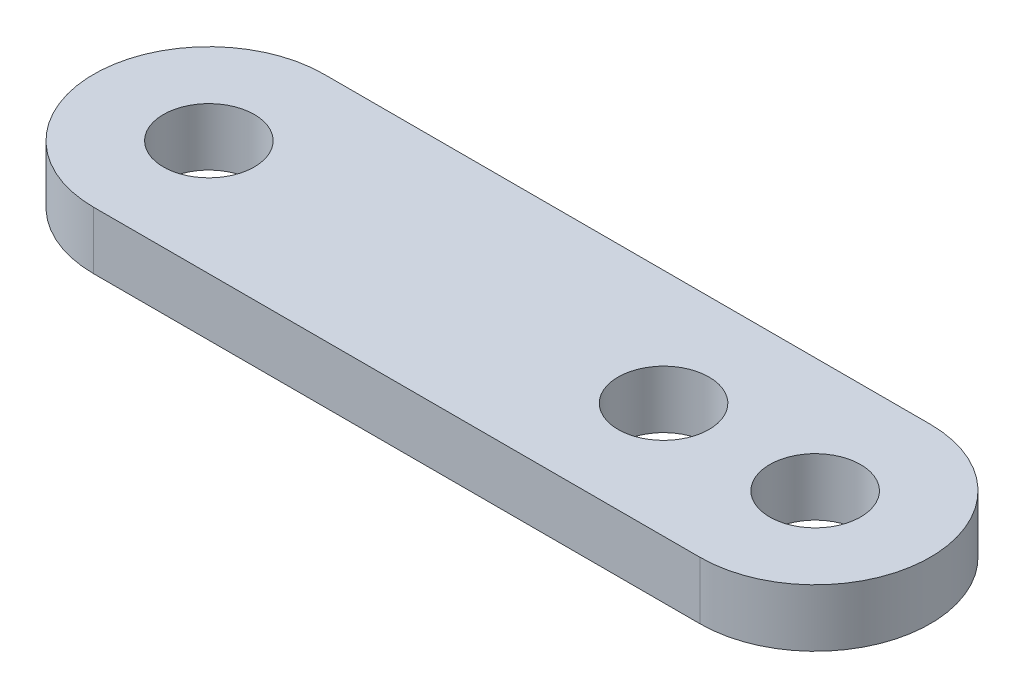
from build123d import *

# Parameters (mm, degrees)
SKETCH1_R           = 1.5
BOSS_EXTRUDE1_DEPTH = 1.9


with BuildPart() as part:
    # Sketch1 → Boss-Extrude1 (new body)
    with BuildSketch(Plane(origin=(0, 0, 0), x_dir=(1, 0, 0), z_dir=(0, 1, 0))):
        with BuildLine():
            ThreePointArc((10, -3.8), (13.8, 0), (10, 3.8))
            Line((10, 3.8), (-10, 3.8))
            ThreePointArc((-10, 3.8), (-13.8, 0), (-10, -3.8))
            Line((-10, -3.8), (10, -3.8))
        make_face()
        with Locations(Location((5, 0, 0), (0, 0, 90))):
            Circle(SKETCH1_R, mode=Mode.SUBTRACT)
        with Locations(Location((10, 0, 0), (0, 0, 90))):
            Circle(SKETCH1_R, mode=Mode.SUBTRACT)
        with Locations(Location((-10, 0, 0), (0, 0, 90))):
            Circle(SKETCH1_R, mode=Mode.SUBTRACT)
    extrude(amount=BOSS_EXTRUDE1_DEPTH)


solid = part.part
